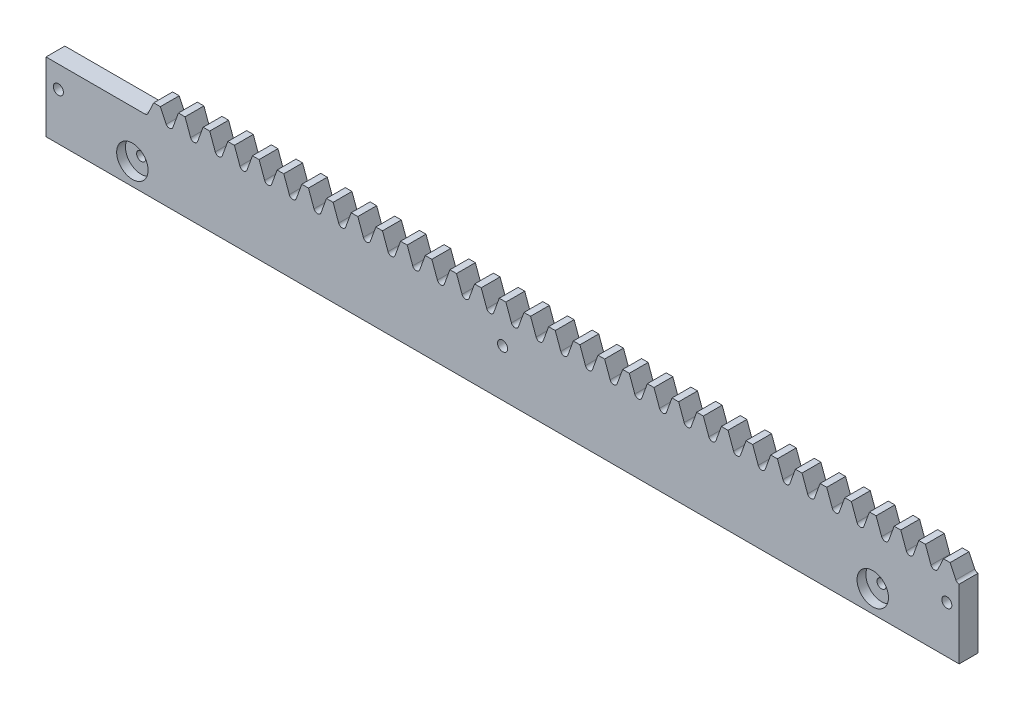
from build123d import *

# Parameters (mm, degrees)
ESQUISSE1_R             = 1.6
EXTRUSION1_DEPTH        = 6
ESQUISSE4_R             = 5
ENL_V_MAT_EXTRU_2_DEPTH = 2.8
ESQUISSE5_R             = 1.45
ENL_V_MAT_EXTRU_3_DEPTH = 2.5


with BuildPart() as part:
    # Esquisse1 → Extrusion1 (new body)
    with BuildSketch(Plane.XY):
        with BuildLine():
            Line((-11.780972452, 22), (19.634954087, 22))
            ThreePointArc((19.634954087, 22), (20.207764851, 22.148388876), (20.636482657, 22.556227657))
            Line((20.636482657, 22.556227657), (22.508375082, 26.5))
            Line((22.508375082, 26.5), (24.615514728, 26.5))
            Line((24.615514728, 26.5), (26.487407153, 22.556227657))
            ThreePointArc((26.487407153, 22.556227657), (26.916124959, 22.148388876), (27.488935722, 22))
            ThreePointArc((27.488935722, 22), (28.165627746, 22.213360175), (28.597563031, 22.776269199))
            Line((28.597563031, 22.776269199), (30.362356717, 27.625))
            Line((30.362356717, 27.625), (32.469496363, 27.625))
            Line((32.469496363, 27.625), (34.234290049, 22.776269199))
            ThreePointArc((34.234290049, 22.776269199), (34.666225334, 22.213360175), (35.342917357, 22))
            ThreePointArc((35.342917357, 22), (36.019609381, 22.213360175), (36.451544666, 22.776269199))
            Line((36.451544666, 22.776269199), (38.216338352, 27.625))
            Line((38.216338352, 27.625), (40.323477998, 27.625))
            Line((40.323477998, 27.625), (42.088271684, 22.776269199))
            ThreePointArc((42.088271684, 22.776269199), (42.520206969, 22.213360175), (43.196898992, 22))
            ThreePointArc((43.196898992, 22), (43.873591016, 22.213360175), (44.305526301, 22.776269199))
            Line((44.305526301, 22.776269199), (46.070319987, 27.625))
            Line((46.070319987, 27.625), (48.177459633, 27.625))
            Line((48.177459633, 27.625), (49.942253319, 22.776269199))
            ThreePointArc((49.942253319, 22.776269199), (50.374188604, 22.213360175), (51.050880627, 22))
            ThreePointArc((51.050880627, 22), (51.727572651, 22.213360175), (52.159507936, 22.776269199))
            Line((52.159507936, 22.776269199), (53.924301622, 27.625))
            Line((53.924301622, 27.625), (56.031441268, 27.625))
            Line((56.031441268, 27.625), (57.796234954, 22.776269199))
            ThreePointArc((57.796234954, 22.776269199), (58.228170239, 22.213360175), (58.904862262, 22))
            ThreePointArc((58.904862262, 22), (59.581554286, 22.213360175), (60.013489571, 22.776269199))
            Line((60.013489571, 22.776269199), (61.778283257, 27.625))
            Line((61.778283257, 27.625), (63.885422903, 27.625))
            Line((63.885422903, 27.625), (65.650216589, 22.776269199))
            ThreePointArc((65.650216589, 22.776269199), (66.082151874, 22.213360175), (66.758843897, 22))
            ThreePointArc((66.758843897, 22), (67.435535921, 22.213360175), (67.867471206, 22.776269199))
            Line((67.867471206, 22.776269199), (69.632264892, 27.625))
            Line((69.632264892, 27.625), (71.739404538, 27.625))
            Line((71.739404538, 27.625), (73.504198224, 22.776269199))
            ThreePointArc((73.504198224, 22.776269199), (73.936133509, 22.213360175), (74.612825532, 22))
            ThreePointArc((74.612825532, 22), (75.289517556, 22.213360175), (75.721452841, 22.776269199))
            Line((75.721452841, 22.776269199), (77.486246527, 27.625))
            Line((77.486246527, 27.625), (79.593386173, 27.625))
            Line((79.593386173, 27.625), (81.358179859, 22.776269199))
            ThreePointArc((81.358179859, 22.776269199), (81.790115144, 22.213360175), (82.466807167, 22))
            ThreePointArc((82.466807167, 22), (83.143499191, 22.213360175), (83.575434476, 22.776269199))
            Line((83.575434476, 22.776269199), (85.340228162, 27.625))
            Line((85.340228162, 27.625), (87.447367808, 27.625))
            Line((87.447367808, 27.625), (89.212161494, 22.776269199))
            ThreePointArc((89.212161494, 22.776269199), (89.644096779, 22.213360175), (90.320788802, 22))
            ThreePointArc((90.320788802, 22), (90.997480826, 22.213360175), (91.429416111, 22.776269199))
            Line((91.429416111, 22.776269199), (93.194209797, 27.625))
            Line((93.194209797, 27.625), (95.301349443, 27.625))
            Line((95.301349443, 27.625), (97.066143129, 22.776269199))
            ThreePointArc((97.066143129, 22.776269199), (97.498078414, 22.213360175), (98.174770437, 22))
            ThreePointArc((98.174770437, 22), (98.851462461, 22.213360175), (99.283397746, 22.776269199))
            Line((99.283397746, 22.776269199), (101.048191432, 27.625))
            Line((101.048191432, 27.625), (103.155331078, 27.625))
            Line((103.155331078, 27.625), (104.920124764, 22.776269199))
            ThreePointArc((104.920124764, 22.776269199), (105.352060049, 22.213360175), (106.028752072, 22))
            ThreePointArc((106.028752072, 22), (106.705444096, 22.213360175), (107.137379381, 22.776269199))
            Line((107.137379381, 22.776269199), (108.902173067, 27.625))
            Line((108.902173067, 27.625), (111.009312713, 27.625))
            Line((111.009312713, 27.625), (112.774106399, 22.776269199))
            ThreePointArc((112.774106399, 22.776269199), (113.206041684, 22.213360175), (113.882733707, 22))
            ThreePointArc((113.882733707, 22), (114.559425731, 22.213360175), (114.991361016, 22.776269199))
            Line((114.991361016, 22.776269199), (116.756154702, 27.625))
            Line((116.756154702, 27.625), (118.863294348, 27.625))
            Line((118.863294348, 27.625), (120.628088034, 22.776269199))
            ThreePointArc((120.628088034, 22.776269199), (121.060023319, 22.213360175), (121.736715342, 22))
            ThreePointArc((121.736715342, 22), (122.413407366, 22.213360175), (122.845342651, 22.776269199))
            Line((122.845342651, 22.776269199), (124.610136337, 27.625))
            Line((124.610136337, 27.625), (126.717275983, 27.625))
            Line((126.717275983, 27.625), (128.482069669, 22.776269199))
            ThreePointArc((128.482069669, 22.776269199), (128.914004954, 22.213360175), (129.590696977, 22))
            ThreePointArc((129.590696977, 22), (130.267389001, 22.213360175), (130.699324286, 22.776269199))
            Line((130.699324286, 22.776269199), (132.464117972, 27.625))
            Line((132.464117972, 27.625), (134.571257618, 27.625))
            Line((134.571257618, 27.625), (136.336051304, 22.776269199))
            ThreePointArc((136.336051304, 22.776269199), (136.767986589, 22.213360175), (137.444678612, 22))
            ThreePointArc((137.444678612, 22), (138.121370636, 22.213360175), (138.553305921, 22.776269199))
            Line((138.553305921, 22.776269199), (140.318099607, 27.625))
            Line((140.318099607, 27.625), (142.425239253, 27.625))
            Line((142.425239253, 27.625), (144.190032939, 22.776269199))
            ThreePointArc((144.190032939, 22.776269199), (144.621968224, 22.213360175), (145.298660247, 22))
            ThreePointArc((145.298660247, 22), (145.975352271, 22.213360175), (146.407287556, 22.776269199))
            Line((146.407287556, 22.776269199), (148.172081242, 27.625))
            Line((148.172081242, 27.625), (150.279220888, 27.625))
            Line((150.279220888, 27.625), (152.044014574, 22.776269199))
            ThreePointArc((152.044014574, 22.776269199), (152.475949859, 22.213360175), (153.152641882, 22))
            ThreePointArc((153.152641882, 22), (153.829333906, 22.213360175), (154.261269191, 22.776269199))
            Line((154.261269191, 22.776269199), (156.026062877, 27.625))
            Line((156.026062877, 27.625), (158.133202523, 27.625))
            Line((158.133202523, 27.625), (159.897996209, 22.776269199))
            ThreePointArc((159.897996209, 22.776269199), (160.329931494, 22.213360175), (161.006623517, 22))
            ThreePointArc((161.006623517, 22), (161.683315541, 22.213360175), (162.115250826, 22.776269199))
            Line((162.115250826, 22.776269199), (163.880044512, 27.625))
            Line((163.880044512, 27.625), (165.987184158, 27.625))
            Line((165.987184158, 27.625), (167.751977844, 22.776269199))
            ThreePointArc((167.751977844, 22.776269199), (168.183913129, 22.213360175), (168.860605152, 22))
            ThreePointArc((168.860605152, 22), (169.537297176, 22.213360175), (169.969232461, 22.776269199))
            Line((169.969232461, 22.776269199), (171.734026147, 27.625))
            Line((171.734026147, 27.625), (173.841165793, 27.625))
            Line((173.841165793, 27.625), (175.605959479, 22.776269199))
            ThreePointArc((175.605959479, 22.776269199), (176.037894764, 22.213360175), (176.714586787, 22))
            ThreePointArc((176.714586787, 22), (177.391278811, 22.213360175), (177.823214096, 22.776269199))
            Line((177.823214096, 22.776269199), (179.588007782, 27.625))
            Line((179.588007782, 27.625), (181.695147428, 27.625))
            Line((181.695147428, 27.625), (183.459941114, 22.776269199))
            ThreePointArc((183.459941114, 22.776269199), (183.891876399, 22.213360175), (184.568568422, 22))
            ThreePointArc((184.568568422, 22), (185.245260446, 22.213360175), (185.677195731, 22.776269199))
            Line((185.677195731, 22.776269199), (187.441989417, 27.625))
            Line((187.441989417, 27.625), (189.549129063, 27.625))
            Line((189.549129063, 27.625), (191.313922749, 22.776269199))
            ThreePointArc((191.313922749, 22.776269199), (191.745858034, 22.213360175), (192.422550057, 22))
            ThreePointArc((192.422550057, 22), (193.099242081, 22.213360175), (193.531177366, 22.776269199))
            Line((193.531177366, 22.776269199), (195.295971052, 27.625))
            Line((195.295971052, 27.625), (197.403110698, 27.625))
            Line((197.403110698, 27.625), (199.167904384, 22.776269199))
            ThreePointArc((199.167904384, 22.776269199), (199.599839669, 22.213360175), (200.276531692, 22))
            ThreePointArc((200.276531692, 22), (200.953223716, 22.213360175), (201.385159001, 22.776269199))
            Line((201.385159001, 22.776269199), (203.149952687, 27.625))
            Line((203.149952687, 27.625), (205.257092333, 27.625))
            Line((205.257092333, 27.625), (207.021886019, 22.776269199))
            ThreePointArc((207.021886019, 22.776269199), (207.453821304, 22.213360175), (208.130513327, 22))
            ThreePointArc((208.130513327, 22), (208.807205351, 22.213360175), (209.239140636, 22.776269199))
            Line((209.239140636, 22.776269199), (211.003934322, 27.625))
            Line((211.003934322, 27.625), (213.111073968, 27.625))
            Line((213.111073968, 27.625), (214.875867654, 22.776269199))
            ThreePointArc((214.875867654, 22.776269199), (215.307802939, 22.213360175), (215.984494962, 22))
            ThreePointArc((215.984494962, 22), (216.661186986, 22.213360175), (217.093122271, 22.776269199))
            Line((217.093122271, 22.776269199), (218.857915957, 27.625))
            Line((218.857915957, 27.625), (220.965055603, 27.625))
            Line((220.965055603, 27.625), (222.729849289, 22.776269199))
            ThreePointArc((222.729849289, 22.776269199), (223.161784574, 22.213360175), (223.838476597, 22))
            ThreePointArc((223.838476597, 22), (224.515168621, 22.213360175), (224.947103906, 22.776269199))
            Line((224.947103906, 22.776269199), (226.711897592, 27.625))
            Line((226.711897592, 27.625), (228.819037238, 27.625))
            Line((228.819037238, 27.625), (230.583830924, 22.776269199))
            ThreePointArc((230.583830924, 22.776269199), (231.015766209, 22.213360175), (231.692458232, 22))
            ThreePointArc((231.692458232, 22), (232.369150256, 22.213360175), (232.801085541, 22.776269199))
            Line((232.801085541, 22.776269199), (234.565879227, 27.625))
            Line((234.565879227, 27.625), (236.673018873, 27.625))
            Line((236.673018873, 27.625), (238.437812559, 22.776269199))
            ThreePointArc((238.437812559, 22.776269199), (238.869747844, 22.213360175), (239.546439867, 22))
            ThreePointArc((239.546439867, 22), (240.223131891, 22.213360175), (240.655067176, 22.776269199))
            Line((240.655067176, 22.776269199), (242.419860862, 27.625))
            Line((242.419860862, 27.625), (244.527000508, 27.625))
            Line((244.527000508, 27.625), (246.291794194, 22.776269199))
            ThreePointArc((246.291794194, 22.776269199), (246.723729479, 22.213360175), (247.400421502, 22))
            ThreePointArc((247.400421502, 22), (248.077113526, 22.213360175), (248.509048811, 22.776269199))
            Line((248.509048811, 22.776269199), (250.273842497, 27.625))
            Line((250.273842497, 27.625), (252.380982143, 27.625))
            Line((252.380982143, 27.625), (254.145775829, 22.776269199))
            ThreePointArc((254.145775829, 22.776269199), (254.577711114, 22.213360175), (255.254403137, 22))
            ThreePointArc((255.254403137, 22), (255.931095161, 22.213360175), (256.363030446, 22.776269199))
            Line((256.363030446, 22.776269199), (258.127824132, 27.625))
            Line((258.127824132, 27.625), (260.234963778, 27.625))
            Line((260.234963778, 27.625), (261.999757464, 22.776269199))
            ThreePointArc((261.999757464, 22.776269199), (262.431692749, 22.213360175), (263.108384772, 22))
            ThreePointArc((263.108384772, 22), (263.785076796, 22.213360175), (264.217012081, 22.776269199))
            Line((264.217012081, 22.776269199), (265.981805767, 27.625))
            Line((265.981805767, 27.625), (268.088945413, 27.625))
            Line((268.088945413, 27.625), (269.853739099, 22.776269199))
            ThreePointArc((269.853739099, 22.776269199), (270.285674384, 22.213360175), (270.962366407, 22))
            ThreePointArc((270.962366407, 22), (271.572652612, 22.17011153), (272.006944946, 22.631389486))
            Line((272.006944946, 22.631389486), (273.835787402, 26.5))
            Line((273.835787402, 26.5), (275.942927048, 26.5))
            Line((275.942927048, 26.5), (277.771769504, 22.631389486))
            ThreePointArc((277.771769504, 22.631389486), (278.206061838, 22.17011153), (278.816348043, 22))
            Line((278.816348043, 22), (278.816348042, 0))
            Line((278.816348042, 0), (-11.780972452, 0))
            Line((-11.780972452, 0), (-11.780972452, 22))
        make_face()
        with Locations((133.517687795, 15)):
            Circle(ESQUISSE1_R, mode=Mode.SUBTRACT)
        with Locations((-7.853981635, 15)):
            Circle(ESQUISSE1_R, mode=Mode.SUBTRACT)
        with Locations((274.889357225, 15)):
            Circle(ESQUISSE1_R, mode=Mode.SUBTRACT)
    extrude(amount=EXTRUSION1_DEPTH)

    # Esquisse4 → Enl_v. mat.-Extru.2 (cut)
    with BuildSketch(Plane.XY.offset(6)):
        with Locations((15.70796327, 7)):
            Circle(ESQUISSE4_R)
        with Locations((251.32741232, 7)):
            Circle(ESQUISSE4_R)
    extrude(amount=-ENL_V_MAT_EXTRU_2_DEPTH, mode=Mode.SUBTRACT)

    # Esquisse5 → Enl_v. mat.-Extru.3 (cut)
    with BuildSketch(Plane.XY.offset(3.2)):
        with Locations((15.70796327, 7)):
            Circle(ESQUISSE5_R)
        with Locations((251.32741232, 7)):
            Circle(ESQUISSE5_R)
    extrude(amount=-ENL_V_MAT_EXTRU_3_DEPTH, mode=Mode.SUBTRACT)


solid = part.part
